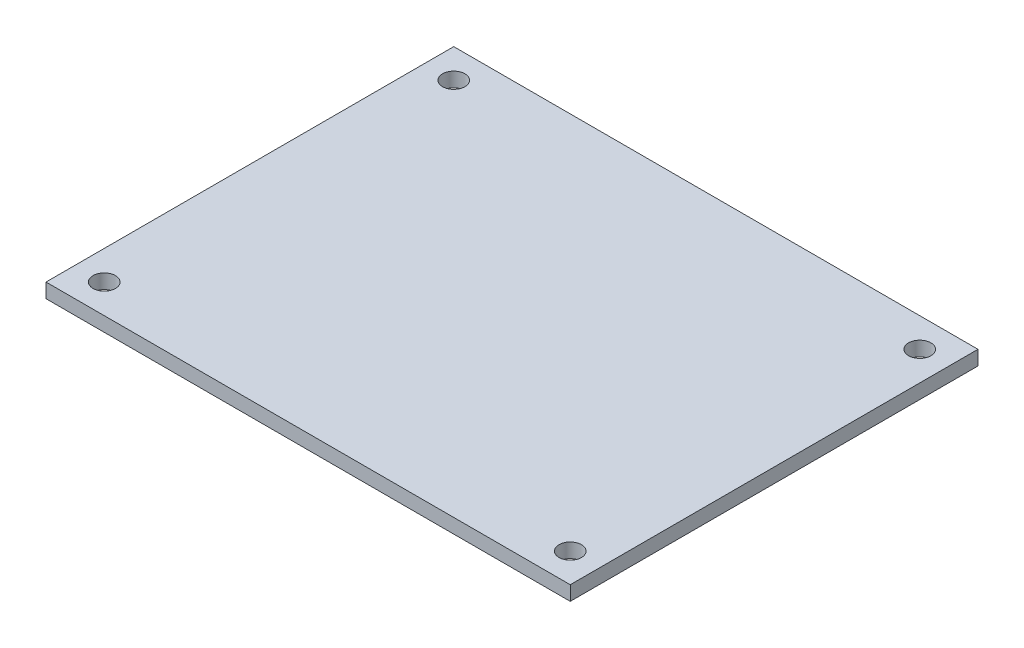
from build123d import *

# Parameters (mm, degrees)
SKETCH1_W           = 57.15
SKETCH1_H           = 44.45
SKETCH1_R           = 1.2192
BOSS_EXTRUDE1_DEPTH = 1.5748


with BuildPart() as part:
    # Sketch1 → Boss-Extrude1 (new body)
    with BuildSketch(Plane(origin=(0, 0, 0), x_dir=(1, 0, 0), z_dir=(0, 1, 0))):
        with Locations((28.575, 22.225)):
            Rectangle(SKETCH1_W, SKETCH1_H)
        with Locations(Location((53.975, 3.175, 0), (0, 0, 270))):
            Circle(SKETCH1_R, mode=Mode.SUBTRACT)
        with Locations(Location((3.175, 3.175, 0), (0, 0, 270))):
            Circle(SKETCH1_R, mode=Mode.SUBTRACT)
        with Locations(Location((3.175, 41.275, 0), (0, 0, 270))):
            Circle(SKETCH1_R, mode=Mode.SUBTRACT)
        with Locations(Location((53.975, 41.275, 0), (0, 0, 270))):
            Circle(SKETCH1_R, mode=Mode.SUBTRACT)
    extrude(amount=BOSS_EXTRUDE1_DEPTH)


solid = part.part
